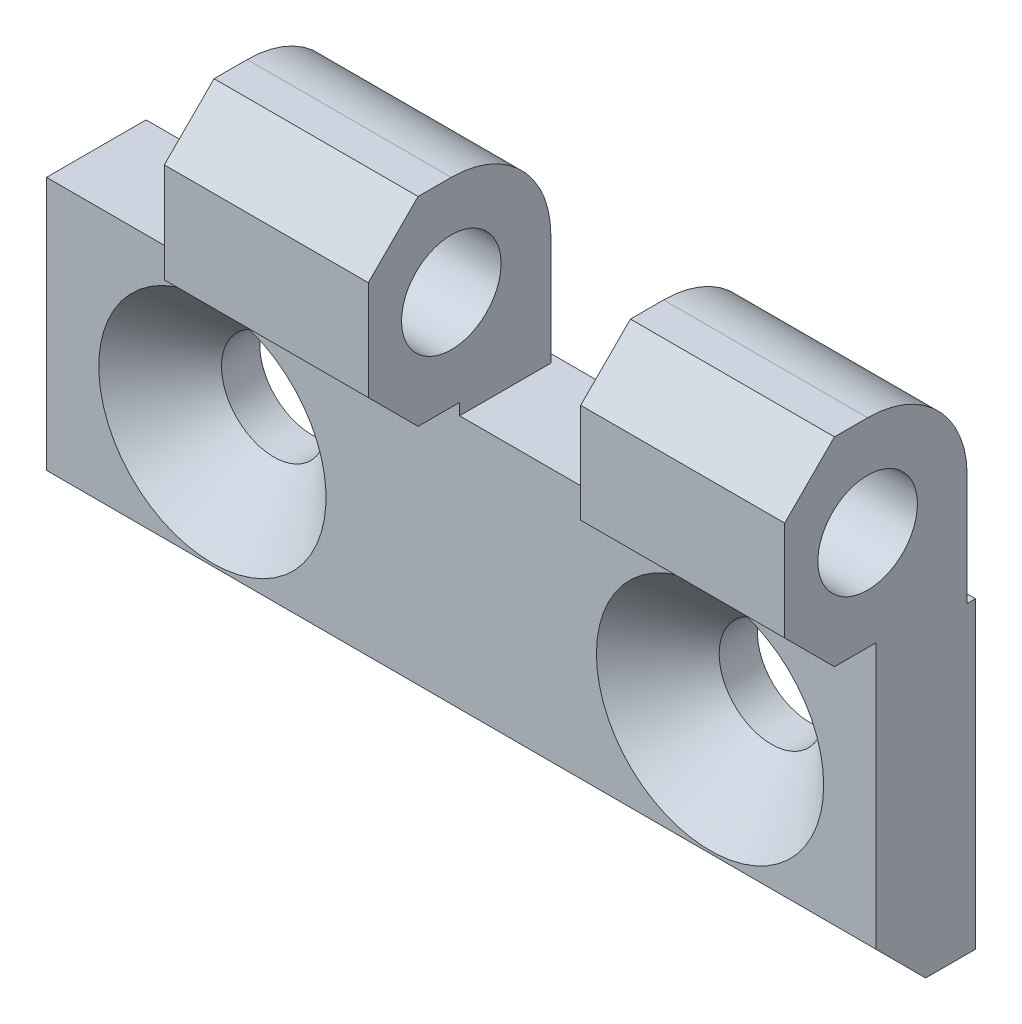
ISO-10303-21;
HEADER;
FILE_DESCRIPTION(('STEP AP214'),'2;1');
FILE_NAME('part.step','',(''),(''),'','','');
FILE_SCHEMA(('AUTOMOTIVE_DESIGN { 1 0 10303 214 1 1 1 1 }'));
ENDSEC;
DATA;
#1=APPLICATION_CONTEXT('core data for automotive mechanical design processes');
#2=APPLICATION_PROTOCOL_DEFINITION('international standard','automotive_design',2000,#1);
#3=PRODUCT_CONTEXT('',#1,'mechanical');
#4=PRODUCT('Part','Part','',(#3));
#5=PRODUCT_RELATED_PRODUCT_CATEGORY('part','',(#4));
#6=PRODUCT_DEFINITION_FORMATION('','',#4);
#7=PRODUCT_DEFINITION_CONTEXT('part definition',#1,'design');
#8=PRODUCT_DEFINITION('design','',#6,#7);
#9=PRODUCT_DEFINITION_SHAPE('','',#8);
#10=(LENGTH_UNIT() NAMED_UNIT(*) SI_UNIT(.MILLI.,.METRE.));
#11=(NAMED_UNIT(*) PLANE_ANGLE_UNIT() SI_UNIT($,.RADIAN.));
#12=(NAMED_UNIT(*) SI_UNIT($,.STERADIAN.) SOLID_ANGLE_UNIT());
#13=UNCERTAINTY_MEASURE_WITH_UNIT(LENGTH_MEASURE(1.E-05),#10,'distance_accuracy_value','');
#14=(GEOMETRIC_REPRESENTATION_CONTEXT(3) GLOBAL_UNCERTAINTY_ASSIGNED_CONTEXT((#13)) GLOBAL_UNIT_ASSIGNED_CONTEXT((#10,
#11,#12)) REPRESENTATION_CONTEXT('',''));
#15=CARTESIAN_POINT('',(0.,0.,0.));
#16=DIRECTION('',(0.,0.,1.));
#17=DIRECTION('',(1.,0.,0.));
#18=AXIS2_PLACEMENT_3D('',#15,#16,#17);
#19=CARTESIAN_POINT('',(14.9,12.,11.5));
#20=DIRECTION('',(0.,-0.707106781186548,0.707106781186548));
#21=DIRECTION('',(0.,0.707106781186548,0.707106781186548));
#22=AXIS2_PLACEMENT_3D('',#19,#20,#21);
#23=PLANE('',#22);
#24=DIRECTION('',(0.,0.707106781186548,0.707106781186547));
#25=VECTOR('',#24,1.);
#26=CARTESIAN_POINT('',(14.9,9.,8.5));
#27=LINE('',#26,#25);
#28=CARTESIAN_POINT('',(14.9,9.,8.5));
#29=VERTEX_POINT('',#28);
#30=CARTESIAN_POINT('',(14.9,12.,11.5));
#31=VERTEX_POINT('',#30);
#32=EDGE_CURVE('E598',#29,#31,#27,.T.);
#33=ORIENTED_EDGE('',*,*,#32,.T.);
#34=DIRECTION('',(-1.,0.,0.));
#35=VECTOR('',#34,1.);
#36=CARTESIAN_POINT('',(14.9,12.,11.5));
#37=LINE('',#36,#35);
#38=CARTESIAN_POINT('',(2.6,12.,11.5));
#39=VERTEX_POINT('',#38);
#40=EDGE_CURVE('E621',#39,#31,#37,.F.);
#41=ORIENTED_EDGE('',*,*,#40,.F.);
#42=DIRECTION('',(0.,0.707106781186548,0.707106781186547));
#43=VECTOR('',#42,1.);
#44=CARTESIAN_POINT('',(2.6,9.,8.5));
#45=LINE('',#44,#43);
#46=CARTESIAN_POINT('',(2.6,9.,8.5));
#47=VERTEX_POINT('',#46);
#48=EDGE_CURVE('E234',#47,#39,#45,.T.);
#49=ORIENTED_EDGE('',*,*,#48,.F.);
#50=DIRECTION('',(1.,0.,0.));
#51=VECTOR('',#50,1.);
#52=CARTESIAN_POINT('',(14.9,9.,8.5));
#53=LINE('',#52,#51);
#54=EDGE_CURVE('E244',#29,#47,#53,.F.);
#55=ORIENTED_EDGE('',*,*,#54,.F.);
#56=EDGE_LOOP('',(#33,#41,#49,#55));
#57=FACE_BOUND('',#56,.T.);
#58=ADVANCED_FACE('F14',(#57),#23,.T.);
#59=CARTESIAN_POINT('',(14.9,9.,11.5));
#60=DIRECTION('',(0.,0.,1.));
#61=DIRECTION('',(-1.,0.,0.));
#62=AXIS2_PLACEMENT_3D('',#59,#60,#61);
#63=PLANE('',#62);
#64=ORIENTED_EDGE('',*,*,#40,.T.);
#65=DIRECTION('',(0.,-1.,0.));
#66=VECTOR('',#65,1.);
#67=CARTESIAN_POINT('',(14.9,-0.85,11.5));
#68=LINE('',#67,#66);
#69=CARTESIAN_POINT('',(14.9,18.,11.5));
#70=VERTEX_POINT('',#69);
#71=EDGE_CURVE('E616',#31,#70,#68,.F.);
#72=ORIENTED_EDGE('',*,*,#71,.T.);
#73=DIRECTION('',(-1.,0.,0.));
#74=VECTOR('',#73,1.);
#75=CARTESIAN_POINT('',(14.9,18.,11.5));
#76=LINE('',#75,#74);
#77=CARTESIAN_POINT('',(2.6,18.,11.5));
#78=VERTEX_POINT('',#77);
#79=EDGE_CURVE('E612',#78,#70,#76,.F.);
#80=ORIENTED_EDGE('',*,*,#79,.F.);
#81=DIRECTION('',(0.,-1.,0.));
#82=VECTOR('',#81,1.);
#83=CARTESIAN_POINT('',(2.6,-0.85,11.5));
#84=LINE('',#83,#82);
#85=EDGE_CURVE('E229',#39,#78,#84,.F.);
#86=ORIENTED_EDGE('',*,*,#85,.F.);
#87=EDGE_LOOP('',(#64,#72,#80,#86));
#88=FACE_BOUND('',#87,.T.);
#89=ADVANCED_FACE('F654',(#88),#63,.T.);
#90=CARTESIAN_POINT('',(14.9,21.,8.5));
#91=DIRECTION('',(0.,0.707106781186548,0.707106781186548));
#92=DIRECTION('',(0.,0.707106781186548,-0.707106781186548));
#93=AXIS2_PLACEMENT_3D('',#90,#91,#92);
#94=PLANE('',#93);
#95=DIRECTION('',(0.,0.707106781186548,-0.707106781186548));
#96=VECTOR('',#95,1.);
#97=CARTESIAN_POINT('',(14.9,18.,11.5));
#98=LINE('',#97,#96);
#99=CARTESIAN_POINT('',(14.9,21.,8.5));
#100=VERTEX_POINT('',#99);
#101=EDGE_CURVE('E537',#70,#100,#98,.T.);
#102=ORIENTED_EDGE('',*,*,#101,.T.);
#103=DIRECTION('',(-1.,0.,0.));
#104=VECTOR('',#103,1.);
#105=CARTESIAN_POINT('',(14.9,21.,8.5));
#106=LINE('',#105,#104);
#107=CARTESIAN_POINT('',(2.6,21.,8.5));
#108=VERTEX_POINT('',#107);
#109=EDGE_CURVE('E609',#108,#100,#106,.F.);
#110=ORIENTED_EDGE('',*,*,#109,.F.);
#111=DIRECTION('',(0.,0.707106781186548,-0.707106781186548));
#112=VECTOR('',#111,1.);
#113=CARTESIAN_POINT('',(2.6,18.,11.5));
#114=LINE('',#113,#112);
#115=EDGE_CURVE('E227',#78,#108,#114,.T.);
#116=ORIENTED_EDGE('',*,*,#115,.F.);
#117=ORIENTED_EDGE('',*,*,#79,.T.);
#118=EDGE_LOOP('',(#102,#110,#116,#117));
#119=FACE_BOUND('',#118,.T.);
#120=ADVANCED_FACE('F657',(#119),#94,.T.);
#121=CARTESIAN_POINT('',(14.9,21.,11.5));
#122=DIRECTION('',(0.,1.,0.));
#123=DIRECTION('',(-1.,0.,0.));
#124=AXIS2_PLACEMENT_3D('',#121,#122,#123);
#125=PLANE('',#124);
#126=ORIENTED_EDGE('',*,*,#109,.T.);
#127=DIRECTION('',(0.,0.,1.));
#128=VECTOR('',#127,1.);
#129=CARTESIAN_POINT('',(14.9,21.,0.));
#130=LINE('',#129,#128);
#131=CARTESIAN_POINT('',(14.9,21.,6.5));
#132=VERTEX_POINT('',#131);
#133=EDGE_CURVE('E535',#100,#132,#130,.F.);
#134=ORIENTED_EDGE('',*,*,#133,.T.);
#135=DIRECTION('',(-1.,0.,0.));
#136=VECTOR('',#135,1.);
#137=CARTESIAN_POINT('',(14.9,21.,6.5));
#138=LINE('',#137,#136);
#139=CARTESIAN_POINT('',(2.6,21.,6.5));
#140=VERTEX_POINT('',#139);
#141=EDGE_CURVE('E187',#140,#132,#138,.F.);
#142=ORIENTED_EDGE('',*,*,#141,.F.);
#143=DIRECTION('',(0.,0.,1.));
#144=VECTOR('',#143,1.);
#145=CARTESIAN_POINT('',(2.6,21.,0.));
#146=LINE('',#145,#144);
#147=EDGE_CURVE('E200',#108,#140,#146,.F.);
#148=ORIENTED_EDGE('',*,*,#147,.F.);
#149=EDGE_LOOP('',(#126,#134,#142,#148));
#150=FACE_BOUND('',#149,.T.);
#151=ADVANCED_FACE('F659',(#150),#125,.T.);
#152=CARTESIAN_POINT('',(14.9,15.,6.5));
#153=DIRECTION('',(-1.,0.,0.));
#154=DIRECTION('',(0.,-1.,0.));
#155=AXIS2_PLACEMENT_3D('',#152,#153,#154);
#156=CYLINDRICAL_SURFACE('',#155,6.);
#157=ORIENTED_EDGE('',*,*,#141,.T.);
#158=CARTESIAN_POINT('',(14.9,15.,6.5));
#159=DIRECTION('',(-1.,0.,0.));
#160=DIRECTION('',(0.,-1.,0.));
#161=AXIS2_PLACEMENT_3D('',#158,#159,#160);
#162=CIRCLE('',#161,6.);
#163=CARTESIAN_POINT('',(14.9,15.,0.5));
#164=VERTEX_POINT('',#163);
#165=EDGE_CURVE('E206',#132,#164,#162,.T.);
#166=ORIENTED_EDGE('',*,*,#165,.T.);
#167=DIRECTION('',(1.,0.,0.));
#168=VECTOR('',#167,1.);
#169=CARTESIAN_POINT('',(14.9,15.,0.5));
#170=LINE('',#169,#168);
#171=CARTESIAN_POINT('',(2.6,15.,0.5));
#172=VERTEX_POINT('',#171);
#173=EDGE_CURVE('E203',#172,#164,#170,.T.);
#174=ORIENTED_EDGE('',*,*,#173,.F.);
#175=CARTESIAN_POINT('',(2.6,15.,6.5));
#176=DIRECTION('',(-1.,0.,0.));
#177=DIRECTION('',(0.,-1.,0.));
#178=AXIS2_PLACEMENT_3D('',#175,#176,#177);
#179=CIRCLE('',#178,6.);
#180=EDGE_CURVE('E17',#140,#172,#179,.T.);
#181=ORIENTED_EDGE('',*,*,#180,.F.);
#182=EDGE_LOOP('',(#157,#166,#174,#181));
#183=FACE_BOUND('',#182,.T.);
#184=ADVANCED_FACE('F204',(#183),#156,.T.);
#185=CARTESIAN_POINT('',(14.9,9.,6.));
#186=DIRECTION('',(0.,-1.,0.));
#187=DIRECTION('',(1.,0.,0.));
#188=AXIS2_PLACEMENT_3D('',#185,#186,#187);
#189=PLANE('',#188);
#190=DIRECTION('',(-1.,0.,0.));
#191=VECTOR('',#190,1.);
#192=CARTESIAN_POINT('',(40.,9.,6.));
#193=LINE('',#192,#191);
#194=CARTESIAN_POINT('',(14.9,9.,6.));
#195=VERTEX_POINT('',#194);
#196=CARTESIAN_POINT('',(2.6,9.,6.));
#197=VERTEX_POINT('',#196);
#198=EDGE_CURVE('E251',#195,#197,#193,.T.);
#199=ORIENTED_EDGE('',*,*,#198,.F.);
#200=DIRECTION('',(0.,0.,1.));
#201=VECTOR('',#200,1.);
#202=CARTESIAN_POINT('',(14.9,9.,0.));
#203=LINE('',#202,#201);
#204=EDGE_CURVE('E209',#195,#29,#203,.T.);
#205=ORIENTED_EDGE('',*,*,#204,.T.);
#206=ORIENTED_EDGE('',*,*,#54,.T.);
#207=DIRECTION('',(0.,0.,1.));
#208=VECTOR('',#207,1.);
#209=CARTESIAN_POINT('',(2.6,9.,0.));
#210=LINE('',#209,#208);
#211=EDGE_CURVE('E239',#197,#47,#210,.T.);
#212=ORIENTED_EDGE('',*,*,#211,.F.);
#213=EDGE_LOOP('',(#199,#205,#206,#212));
#214=FACE_BOUND('',#213,.T.);
#215=ADVANCED_FACE('F637',(#214),#189,.T.);
#216=CARTESIAN_POINT('',(27.7,-0.85,0.));
#217=DIRECTION('',(1.,0.,0.));
#218=DIRECTION('',(0.,1.,0.));
#219=AXIS2_PLACEMENT_3D('',#216,#217,#218);
#220=PLANE('',#219);
#221=DIRECTION('',(0.,-1.,0.));
#222=VECTOR('',#221,1.);
#223=CARTESIAN_POINT('',(27.7,-10.,6.));
#224=LINE('',#223,#222);
#225=CARTESIAN_POINT('',(27.7,9.,6.));
#226=VERTEX_POINT('',#225);
#227=CARTESIAN_POINT('',(27.7,8.3,6.));
#228=VERTEX_POINT('',#227);
#229=EDGE_CURVE('E532',#226,#228,#224,.T.);
#230=ORIENTED_EDGE('',*,*,#229,.F.);
#231=DIRECTION('',(0.,0.,1.));
#232=VECTOR('',#231,1.);
#233=CARTESIAN_POINT('',(27.7,9.,11.5));
#234=LINE('',#233,#232);
#235=CARTESIAN_POINT('',(27.7,9.,8.5));
#236=VERTEX_POINT('',#235);
#237=EDGE_CURVE('E516',#236,#226,#234,.F.);
#238=ORIENTED_EDGE('',*,*,#237,.F.);
#239=DIRECTION('',(0.,0.707106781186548,0.707106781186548));
#240=VECTOR('',#239,1.);
#241=CARTESIAN_POINT('',(27.7,9.,8.5));
#242=LINE('',#241,#240);
#243=CARTESIAN_POINT('',(27.7,12.,11.5));
#244=VERTEX_POINT('',#243);
#245=EDGE_CURVE('E507',#244,#236,#242,.F.);
#246=ORIENTED_EDGE('',*,*,#245,.F.);
#247=DIRECTION('',(0.,-1.,0.));
#248=VECTOR('',#247,1.);
#249=CARTESIAN_POINT('',(27.7,21.,11.5));
#250=LINE('',#249,#248);
#251=CARTESIAN_POINT('',(27.7,18.,11.5));
#252=VERTEX_POINT('',#251);
#253=EDGE_CURVE('E497',#252,#244,#250,.T.);
#254=ORIENTED_EDGE('',*,*,#253,.F.);
#255=DIRECTION('',(0.,0.707106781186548,-0.707106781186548));
#256=VECTOR('',#255,1.);
#257=CARTESIAN_POINT('',(27.7,18.,11.5));
#258=LINE('',#257,#256);
#259=CARTESIAN_POINT('',(27.7,21.,8.5));
#260=VERTEX_POINT('',#259);
#261=EDGE_CURVE('E487',#260,#252,#258,.F.);
#262=ORIENTED_EDGE('',*,*,#261,.F.);
#263=DIRECTION('',(0.,0.,1.));
#264=VECTOR('',#263,1.);
#265=CARTESIAN_POINT('',(27.7,21.,6.5));
#266=LINE('',#265,#264);
#267=CARTESIAN_POINT('',(27.7,21.,6.5));
#268=VERTEX_POINT('',#267);
#269=EDGE_CURVE('E474',#268,#260,#266,.T.);
#270=ORIENTED_EDGE('',*,*,#269,.F.);
#271=CARTESIAN_POINT('',(27.7,15.,6.5));
#272=DIRECTION('',(1.,0.,0.));
#273=DIRECTION('',(0.,1.,0.));
#274=AXIS2_PLACEMENT_3D('',#271,#272,#273);
#275=CIRCLE('',#274,6.);
#276=CARTESIAN_POINT('',(27.7,15.,0.5));
#277=VERTEX_POINT('',#276);
#278=EDGE_CURVE('E473',#277,#268,#275,.T.);
#279=ORIENTED_EDGE('',*,*,#278,.F.);
#280=DIRECTION('',(0.,-1.,0.));
#281=VECTOR('',#280,1.);
#282=CARTESIAN_POINT('',(27.7,8.3,0.5));
#283=LINE('',#282,#281);
#284=CARTESIAN_POINT('',(27.7,8.3,0.5));
#285=VERTEX_POINT('',#284);
#286=EDGE_CURVE('E460',#285,#277,#283,.F.);
#287=ORIENTED_EDGE('',*,*,#286,.F.);
#288=DIRECTION('',(0.,0.,1.));
#289=VECTOR('',#288,1.);
#290=CARTESIAN_POINT('',(27.7,8.3,6.));
#291=LINE('',#290,#289);
#292=EDGE_CURVE('E463',#228,#285,#291,.F.);
#293=ORIENTED_EDGE('',*,*,#292,.F.);
#294=EDGE_LOOP('',(#230,#238,#246,#254,#262,#270,#279,#287,#293));
#295=FACE_BOUND('',#294,.T.);
#296=CARTESIAN_POINT('',(27.7,15.,6.5));
#297=DIRECTION('',(1.,0.,0.));
#298=DIRECTION('',(0.,0.,-1.));
#299=AXIS2_PLACEMENT_3D('',#296,#297,#298);
#300=CIRCLE('',#299,3.);
#301=CARTESIAN_POINT('',(27.7,15.,3.5));
#302=VERTEX_POINT('',#301);
#303=EDGE_CURVE('E629',#302,#302,#300,.F.);
#304=ORIENTED_EDGE('',*,*,#303,.F.);
#305=EDGE_LOOP('',(#304));
#306=FACE_BOUND('',#305,.T.);
#307=ADVANCED_FACE('F695',(#295,#306),#220,.F.);
#308=CARTESIAN_POINT('',(2.6,-0.85,0.));
#309=DIRECTION('',(-1.,0.,0.));
#310=DIRECTION('',(0.,-1.,0.));
#311=AXIS2_PLACEMENT_3D('',#308,#309,#310);
#312=PLANE('',#311);
#313=DIRECTION('',(0.,-1.,0.));
#314=VECTOR('',#313,1.);
#315=CARTESIAN_POINT('',(2.6,15.,0.5));
#316=LINE('',#315,#314);
#317=CARTESIAN_POINT('',(2.6,8.3,0.5));
#318=VERTEX_POINT('',#317);
#319=EDGE_CURVE('E197',#318,#172,#316,.F.);
#320=ORIENTED_EDGE('',*,*,#319,.F.);
#321=DIRECTION('',(0.,0.,1.));
#322=VECTOR('',#321,1.);
#323=CARTESIAN_POINT('',(2.6,8.3,6.));
#324=LINE('',#323,#322);
#325=CARTESIAN_POINT('',(2.6,8.3,6.));
#326=VERTEX_POINT('',#325);
#327=EDGE_CURVE('E222',#326,#318,#324,.F.);
#328=ORIENTED_EDGE('',*,*,#327,.F.);
#329=DIRECTION('',(0.,-1.,0.));
#330=VECTOR('',#329,1.);
#331=CARTESIAN_POINT('',(2.6,-10.,6.));
#332=LINE('',#331,#330);
#333=EDGE_CURVE('E247',#197,#326,#332,.T.);
#334=ORIENTED_EDGE('',*,*,#333,.F.);
#335=ORIENTED_EDGE('',*,*,#211,.T.);
#336=ORIENTED_EDGE('',*,*,#48,.T.);
#337=ORIENTED_EDGE('',*,*,#85,.T.);
#338=ORIENTED_EDGE('',*,*,#115,.T.);
#339=ORIENTED_EDGE('',*,*,#147,.T.);
#340=ORIENTED_EDGE('',*,*,#180,.T.);
#341=EDGE_LOOP('',(#320,#328,#334,#335,#336,#337,#338,#339,#340));
#342=FACE_BOUND('',#341,.T.);
#343=CARTESIAN_POINT('',(2.6,15.,6.5));
#344=DIRECTION('',(-1.,0.,0.));
#345=DIRECTION('',(0.,0.,1.));
#346=AXIS2_PLACEMENT_3D('',#343,#344,#345);
#347=CIRCLE('',#346,3.);
#348=CARTESIAN_POINT('',(2.6,15.,9.5));
#349=VERTEX_POINT('',#348);
#350=EDGE_CURVE('E947',#349,#349,#347,.T.);
#351=ORIENTED_EDGE('',*,*,#350,.F.);
#352=EDGE_LOOP('',(#351));
#353=FACE_BOUND('',#352,.T.);
#354=ADVANCED_FACE('F193',(#342,#353),#312,.T.);
#355=CARTESIAN_POINT('',(14.9,15.,0.5));
#356=DIRECTION('',(0.,0.,-1.));
#357=DIRECTION('',(1.,0.,0.));
#358=AXIS2_PLACEMENT_3D('',#355,#356,#357);
#359=PLANE('',#358);
#360=DIRECTION('',(0.,-1.,0.));
#361=VECTOR('',#360,1.);
#362=CARTESIAN_POINT('',(14.9,-0.85,0.5));
#363=LINE('',#362,#361);
#364=CARTESIAN_POINT('',(14.9,8.3,0.5));
#365=VERTEX_POINT('',#364);
#366=EDGE_CURVE('E530',#164,#365,#363,.T.);
#367=ORIENTED_EDGE('',*,*,#366,.T.);
#368=DIRECTION('',(-1.,0.,0.));
#369=VECTOR('',#368,1.);
#370=CARTESIAN_POINT('',(40.,8.3,0.5));
#371=LINE('',#370,#369);
#372=EDGE_CURVE('E213',#318,#365,#371,.F.);
#373=ORIENTED_EDGE('',*,*,#372,.F.);
#374=ORIENTED_EDGE('',*,*,#319,.T.);
#375=ORIENTED_EDGE('',*,*,#173,.T.);
#376=EDGE_LOOP('',(#367,#373,#374,#375));
#377=FACE_BOUND('',#376,.T.);
#378=ADVANCED_FACE('F211',(#377),#359,.T.);
#379=CARTESIAN_POINT('',(14.9,-0.85,0.));
#380=DIRECTION('',(-1.,0.,0.));
#381=DIRECTION('',(0.,-1.,0.));
#382=AXIS2_PLACEMENT_3D('',#379,#380,#381);
#383=PLANE('',#382);
#384=ORIENTED_EDGE('',*,*,#165,.F.);
#385=ORIENTED_EDGE('',*,*,#133,.F.);
#386=ORIENTED_EDGE('',*,*,#101,.F.);
#387=ORIENTED_EDGE('',*,*,#71,.F.);
#388=ORIENTED_EDGE('',*,*,#32,.F.);
#389=ORIENTED_EDGE('',*,*,#204,.F.);
#390=DIRECTION('',(0.,-1.,0.));
#391=VECTOR('',#390,1.);
#392=CARTESIAN_POINT('',(14.9,-10.,6.));
#393=LINE('',#392,#391);
#394=CARTESIAN_POINT('',(14.9,8.3,6.));
#395=VERTEX_POINT('',#394);
#396=EDGE_CURVE('E557',#395,#195,#393,.F.);
#397=ORIENTED_EDGE('',*,*,#396,.F.);
#398=DIRECTION('',(0.,0.,1.));
#399=VECTOR('',#398,1.);
#400=CARTESIAN_POINT('',(14.9,8.3,6.));
#401=LINE('',#400,#399);
#402=EDGE_CURVE('E520',#365,#395,#401,.T.);
#403=ORIENTED_EDGE('',*,*,#402,.F.);
#404=ORIENTED_EDGE('',*,*,#366,.F.);
#405=EDGE_LOOP('',(#384,#385,#386,#387,#388,#389,#397,#403,#404));
#406=FACE_BOUND('',#405,.T.);
#407=CARTESIAN_POINT('',(14.9,15.,6.5));
#408=DIRECTION('',(-1.,0.,0.));
#409=DIRECTION('',(0.,0.,1.));
#410=AXIS2_PLACEMENT_3D('',#407,#408,#409);
#411=CIRCLE('',#410,3.);
#412=CARTESIAN_POINT('',(14.9,15.,9.5));
#413=VERTEX_POINT('',#412);
#414=EDGE_CURVE('E944',#413,#413,#411,.F.);
#415=ORIENTED_EDGE('',*,*,#414,.F.);
#416=EDGE_LOOP('',(#415));
#417=FACE_BOUND('',#416,.T.);
#418=ADVANCED_FACE('F649',(#406,#417),#383,.F.);
#419=CARTESIAN_POINT('',(40.,-10.,6.));
#420=DIRECTION('',(0.,0.,1.));
#421=DIRECTION('',(-1.,0.,0.));
#422=AXIS2_PLACEMENT_3D('',#419,#420,#421);
#423=PLANE('',#422);
#424=DIRECTION('',(-1.,0.,0.));
#425=VECTOR('',#424,1.);
#426=CARTESIAN_POINT('',(40.,8.3,6.));
#427=LINE('',#426,#425);
#428=EDGE_CURVE('E548',#395,#228,#427,.F.);
#429=ORIENTED_EDGE('',*,*,#428,.F.);
#430=ORIENTED_EDGE('',*,*,#396,.T.);
#431=ORIENTED_EDGE('',*,*,#198,.T.);
#432=ORIENTED_EDGE('',*,*,#333,.T.);
#433=DIRECTION('',(-1.,0.,0.));
#434=VECTOR('',#433,1.);
#435=CARTESIAN_POINT('',(40.,8.3,6.));
#436=LINE('',#435,#434);
#437=CARTESIAN_POINT('',(-10.,8.3,6.));
#438=VERTEX_POINT('',#437);
#439=EDGE_CURVE('E224',#438,#326,#436,.F.);
#440=ORIENTED_EDGE('',*,*,#439,.F.);
#441=DIRECTION('',(0.,-1.,0.));
#442=VECTOR('',#441,1.);
#443=CARTESIAN_POINT('',(-10.,-0.85,6.));
#444=LINE('',#443,#442);
#445=CARTESIAN_POINT('',(-10.,-7.,6.));
#446=VERTEX_POINT('',#445);
#447=EDGE_CURVE('E553',#446,#438,#444,.F.);
#448=ORIENTED_EDGE('',*,*,#447,.F.);
#449=DIRECTION('',(-1.,0.,0.));
#450=VECTOR('',#449,1.);
#451=CARTESIAN_POINT('',(40.,-7.,6.));
#452=LINE('',#451,#450);
#453=CARTESIAN_POINT('',(40.,-7.,6.));
#454=VERTEX_POINT('',#453);
#455=EDGE_CURVE('E452',#454,#446,#452,.T.);
#456=ORIENTED_EDGE('',*,*,#455,.F.);
#457=DIRECTION('',(0.,-1.,0.));
#458=VECTOR('',#457,1.);
#459=CARTESIAN_POINT('',(40.,-0.85,6.));
#460=LINE('',#459,#458);
#461=CARTESIAN_POINT('',(40.,9.,6.));
#462=VERTEX_POINT('',#461);
#463=EDGE_CURVE('E511',#454,#462,#460,.F.);
#464=ORIENTED_EDGE('',*,*,#463,.T.);
#465=DIRECTION('',(1.,0.,0.));
#466=VECTOR('',#465,1.);
#467=CARTESIAN_POINT('',(27.7,9.,6.));
#468=LINE('',#467,#466);
#469=EDGE_CURVE('E250',#226,#462,#468,.T.);
#470=ORIENTED_EDGE('',*,*,#469,.F.);
#471=ORIENTED_EDGE('',*,*,#229,.T.);
#472=EDGE_LOOP('',(#429,#430,#431,#432,#440,#448,#456,#464,#470,#471));
#473=FACE_BOUND('',#472,.T.);
#474=CARTESIAN_POINT('',(30.,0.,5.99999999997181));
#475=DIRECTION('',(0.,0.,1.));
#476=DIRECTION('',(-1.,0.,0.));
#477=AXIS2_PLACEMENT_3D('',#474,#475,#476);
#478=CIRCLE('',#477,6.84999999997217);
#479=CARTESIAN_POINT('',(23.1500000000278,0.,5.99999999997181));
#480=VERTEX_POINT('',#479);
#481=EDGE_CURVE('E451',#480,#480,#478,.F.);
#482=ORIENTED_EDGE('',*,*,#481,.T.);
#483=EDGE_LOOP('',(#482));
#484=FACE_BOUND('',#483,.T.);
#485=CARTESIAN_POINT('',(0.,0.,5.99999999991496));
#486=DIRECTION('',(0.,0.,1.));
#487=DIRECTION('',(0.,1.,0.));
#488=AXIS2_PLACEMENT_3D('',#485,#486,#487);
#489=CIRCLE('',#488,6.8500000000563);
#490=CARTESIAN_POINT('',(0.,6.8500000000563,5.99999999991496));
#491=VERTEX_POINT('',#490);
#492=EDGE_CURVE('E441',#491,#491,#489,.F.);
#493=ORIENTED_EDGE('',*,*,#492,.T.);
#494=EDGE_LOOP('',(#493));
#495=FACE_BOUND('',#494,.T.);
#496=ADVANCED_FACE('F645',(#473,#484,#495),#423,.T.);
#497=CARTESIAN_POINT('',(27.7,9.,11.5));
#498=DIRECTION('',(0.,-1.,0.));
#499=DIRECTION('',(1.,0.,0.));
#500=AXIS2_PLACEMENT_3D('',#497,#498,#499);
#501=PLANE('',#500);
#502=DIRECTION('',(-1.,0.,0.));
#503=VECTOR('',#502,1.);
#504=CARTESIAN_POINT('',(27.7,9.,8.5));
#505=LINE('',#504,#503);
#506=CARTESIAN_POINT('',(40.,9.,8.5));
#507=VERTEX_POINT('',#506);
#508=EDGE_CURVE('E498',#236,#507,#505,.F.);
#509=ORIENTED_EDGE('',*,*,#508,.F.);
#510=ORIENTED_EDGE('',*,*,#237,.T.);
#511=ORIENTED_EDGE('',*,*,#469,.T.);
#512=DIRECTION('',(0.,0.,1.));
#513=VECTOR('',#512,1.);
#514=CARTESIAN_POINT('',(40.,9.,0.));
#515=LINE('',#514,#513);
#516=EDGE_CURVE('E502',#462,#507,#515,.T.);
#517=ORIENTED_EDGE('',*,*,#516,.T.);
#518=EDGE_LOOP('',(#509,#510,#511,#517));
#519=FACE_BOUND('',#518,.T.);
#520=ADVANCED_FACE('F737',(#519),#501,.T.);
#521=CARTESIAN_POINT('',(27.7,9.,8.5));
#522=DIRECTION('',(0.,-0.707106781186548,0.707106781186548));
#523=DIRECTION('',(0.,0.707106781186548,0.707106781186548));
#524=AXIS2_PLACEMENT_3D('',#521,#522,#523);
#525=PLANE('',#524);
#526=ORIENTED_EDGE('',*,*,#245,.T.);
#527=ORIENTED_EDGE('',*,*,#508,.T.);
#528=DIRECTION('',(0.,0.707106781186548,0.707106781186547));
#529=VECTOR('',#528,1.);
#530=CARTESIAN_POINT('',(40.,9.,8.5));
#531=LINE('',#530,#529);
#532=CARTESIAN_POINT('',(40.,12.,11.5));
#533=VERTEX_POINT('',#532);
#534=EDGE_CURVE('E491',#507,#533,#531,.T.);
#535=ORIENTED_EDGE('',*,*,#534,.T.);
#536=DIRECTION('',(-1.,0.,0.));
#537=VECTOR('',#536,1.);
#538=CARTESIAN_POINT('',(27.7,12.,11.5));
#539=LINE('',#538,#537);
#540=EDGE_CURVE('E494',#244,#533,#539,.F.);
#541=ORIENTED_EDGE('',*,*,#540,.F.);
#542=EDGE_LOOP('',(#526,#527,#535,#541));
#543=FACE_BOUND('',#542,.T.);
#544=ADVANCED_FACE('F746',(#543),#525,.T.);
#545=CARTESIAN_POINT('',(27.7,21.,11.5));
#546=DIRECTION('',(0.,0.,1.));
#547=DIRECTION('',(-1.,0.,0.));
#548=AXIS2_PLACEMENT_3D('',#545,#546,#547);
#549=PLANE('',#548);
#550=DIRECTION('',(-1.,0.,0.));
#551=VECTOR('',#550,1.);
#552=CARTESIAN_POINT('',(27.7,18.,11.5));
#553=LINE('',#552,#551);
#554=CARTESIAN_POINT('',(40.,18.,11.5));
#555=VERTEX_POINT('',#554);
#556=EDGE_CURVE('E478',#252,#555,#553,.F.);
#557=ORIENTED_EDGE('',*,*,#556,.F.);
#558=ORIENTED_EDGE('',*,*,#253,.T.);
#559=ORIENTED_EDGE('',*,*,#540,.T.);
#560=DIRECTION('',(0.,-1.,0.));
#561=VECTOR('',#560,1.);
#562=CARTESIAN_POINT('',(40.,-0.85,11.5));
#563=LINE('',#562,#561);
#564=EDGE_CURVE('E482',#533,#555,#563,.F.);
#565=ORIENTED_EDGE('',*,*,#564,.T.);
#566=EDGE_LOOP('',(#557,#558,#559,#565));
#567=FACE_BOUND('',#566,.T.);
#568=ADVANCED_FACE('F756',(#567),#549,.T.);
#569=CARTESIAN_POINT('',(27.7,18.,11.5));
#570=DIRECTION('',(0.,0.707106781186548,0.707106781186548));
#571=DIRECTION('',(0.,0.707106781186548,-0.707106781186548));
#572=AXIS2_PLACEMENT_3D('',#569,#570,#571);
#573=PLANE('',#572);
#574=ORIENTED_EDGE('',*,*,#261,.T.);
#575=ORIENTED_EDGE('',*,*,#556,.T.);
#576=DIRECTION('',(0.,0.707106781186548,-0.707106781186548));
#577=VECTOR('',#576,1.);
#578=CARTESIAN_POINT('',(40.,18.,11.5));
#579=LINE('',#578,#577);
#580=CARTESIAN_POINT('',(40.,21.,8.5));
#581=VERTEX_POINT('',#580);
#582=EDGE_CURVE('E425',#555,#581,#579,.T.);
#583=ORIENTED_EDGE('',*,*,#582,.T.);
#584=DIRECTION('',(-1.,0.,0.));
#585=VECTOR('',#584,1.);
#586=CARTESIAN_POINT('',(27.7,21.,8.5));
#587=LINE('',#586,#585);
#588=EDGE_CURVE('E475',#260,#581,#587,.F.);
#589=ORIENTED_EDGE('',*,*,#588,.F.);
#590=EDGE_LOOP('',(#574,#575,#583,#589));
#591=FACE_BOUND('',#590,.T.);
#592=ADVANCED_FACE('F766',(#591),#573,.T.);
#593=CARTESIAN_POINT('',(27.7,21.,6.5));
#594=DIRECTION('',(0.,1.,0.));
#595=DIRECTION('',(-1.,0.,0.));
#596=AXIS2_PLACEMENT_3D('',#593,#594,#595);
#597=PLANE('',#596);
#598=DIRECTION('',(1.,0.,0.));
#599=VECTOR('',#598,1.);
#600=CARTESIAN_POINT('',(27.7,21.,6.5));
#601=LINE('',#600,#599);
#602=CARTESIAN_POINT('',(40.,21.,6.5));
#603=VERTEX_POINT('',#602);
#604=EDGE_CURVE('E470',#268,#603,#601,.T.);
#605=ORIENTED_EDGE('',*,*,#604,.F.);
#606=ORIENTED_EDGE('',*,*,#269,.T.);
#607=ORIENTED_EDGE('',*,*,#588,.T.);
#608=DIRECTION('',(0.,0.,1.));
#609=VECTOR('',#608,1.);
#610=CARTESIAN_POINT('',(40.,21.,0.));
#611=LINE('',#610,#609);
#612=EDGE_CURVE('E423',#581,#603,#611,.F.);
#613=ORIENTED_EDGE('',*,*,#612,.T.);
#614=EDGE_LOOP('',(#605,#606,#607,#613));
#615=FACE_BOUND('',#614,.T.);
#616=ADVANCED_FACE('F776',(#615),#597,.T.);
#617=CARTESIAN_POINT('',(27.7,15.,6.5));
#618=DIRECTION('',(1.,0.,0.));
#619=DIRECTION('',(0.,1.,0.));
#620=AXIS2_PLACEMENT_3D('',#617,#618,#619);
#621=CYLINDRICAL_SURFACE('',#620,6.);
#622=DIRECTION('',(1.,0.,0.));
#623=VECTOR('',#622,1.);
#624=CARTESIAN_POINT('',(27.7,15.,0.5));
#625=LINE('',#624,#623);
#626=CARTESIAN_POINT('',(40.,15.,0.5));
#627=VERTEX_POINT('',#626);
#628=EDGE_CURVE('E457',#277,#627,#625,.T.);
#629=ORIENTED_EDGE('',*,*,#628,.F.);
#630=ORIENTED_EDGE('',*,*,#278,.T.);
#631=ORIENTED_EDGE('',*,*,#604,.T.);
#632=CARTESIAN_POINT('',(40.,15.,6.5));
#633=DIRECTION('',(1.,0.,0.));
#634=DIRECTION('',(0.,1.,0.));
#635=AXIS2_PLACEMENT_3D('',#632,#633,#634);
#636=CIRCLE('',#635,6.);
#637=EDGE_CURVE('E420',#603,#627,#636,.F.);
#638=ORIENTED_EDGE('',*,*,#637,.T.);
#639=EDGE_LOOP('',(#629,#630,#631,#638));
#640=FACE_BOUND('',#639,.T.);
#641=ADVANCED_FACE('F786',(#640),#621,.T.);
#642=CARTESIAN_POINT('',(27.7,8.3,0.5));
#643=DIRECTION('',(0.,0.,-1.));
#644=DIRECTION('',(1.,0.,0.));
#645=AXIS2_PLACEMENT_3D('',#642,#643,#644);
#646=PLANE('',#645);
#647=ORIENTED_EDGE('',*,*,#286,.T.);
#648=ORIENTED_EDGE('',*,*,#628,.T.);
#649=DIRECTION('',(0.,-1.,0.));
#650=VECTOR('',#649,1.);
#651=CARTESIAN_POINT('',(40.,-0.85,0.5));
#652=LINE('',#651,#650);
#653=CARTESIAN_POINT('',(40.,8.3,0.5));
#654=VERTEX_POINT('',#653);
#655=EDGE_CURVE('E418',#627,#654,#652,.T.);
#656=ORIENTED_EDGE('',*,*,#655,.T.);
#657=DIRECTION('',(-1.,0.,0.));
#658=VECTOR('',#657,1.);
#659=CARTESIAN_POINT('',(40.,8.3,0.5));
#660=LINE('',#659,#658);
#661=EDGE_CURVE('E433',#285,#654,#660,.F.);
#662=ORIENTED_EDGE('',*,*,#661,.F.);
#663=EDGE_LOOP('',(#647,#648,#656,#662));
#664=FACE_BOUND('',#663,.T.);
#665=ADVANCED_FACE('F796',(#664),#646,.T.);
#666=CARTESIAN_POINT('',(40.,-7.,6.));
#667=DIRECTION('',(0.,-0.707106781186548,0.707106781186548));
#668=DIRECTION('',(0.,0.707106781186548,0.707106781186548));
#669=AXIS2_PLACEMENT_3D('',#666,#667,#668);
#670=PLANE('',#669);
#671=DIRECTION('',(0.,0.707106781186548,0.707106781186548));
#672=VECTOR('',#671,1.);
#673=CARTESIAN_POINT('',(40.,-10.,3.));
#674=LINE('',#673,#672);
#675=CARTESIAN_POINT('',(40.,-10.,3.));
#676=VERTEX_POINT('',#675);
#677=EDGE_CURVE('E416',#676,#454,#674,.T.);
#678=ORIENTED_EDGE('',*,*,#677,.T.);
#679=ORIENTED_EDGE('',*,*,#455,.T.);
#680=DIRECTION('',(0.,0.707106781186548,0.707106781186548));
#681=VECTOR('',#680,1.);
#682=CARTESIAN_POINT('',(-10.,-10.,3.));
#683=LINE('',#682,#681);
#684=CARTESIAN_POINT('',(-10.,-10.,3.));
#685=VERTEX_POINT('',#684);
#686=EDGE_CURVE('E437',#685,#446,#683,.T.);
#687=ORIENTED_EDGE('',*,*,#686,.F.);
#688=DIRECTION('',(1.,0.,0.));
#689=VECTOR('',#688,1.);
#690=CARTESIAN_POINT('',(40.,-10.,3.));
#691=LINE('',#690,#689);
#692=EDGE_CURVE('E438',#676,#685,#691,.F.);
#693=ORIENTED_EDGE('',*,*,#692,.F.);
#694=EDGE_LOOP('',(#678,#679,#687,#693));
#695=FACE_BOUND('',#694,.T.);
#696=ADVANCED_FACE('F289',(#695),#670,.T.);
#697=CARTESIAN_POINT('',(26.8143086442,4.,2.));
#698=DIRECTION('',(-1.,0.,0.));
#699=DIRECTION('',(0.,-1.,0.));
#700=AXIS2_PLACEMENT_3D('',#697,#698,#699);
#701=CYLINDRICAL_SURFACE('',#700,1.);
#702=DIRECTION('',(-1.,0.,0.));
#703=VECTOR('',#702,1.);
#704=CARTESIAN_POINT('',(3.31662479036,5.,2.));
#705=LINE('',#704,#703);
#706=CARTESIAN_POINT('',(3.316624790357,4.99999999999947,2.));
#707=VERTEX_POINT('',#706);
#708=CARTESIAN_POINT('',(26.6833752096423,5.,2.));
#709=VERTEX_POINT('',#708);
#710=EDGE_CURVE('E302',#707,#709,#705,.F.);
#711=ORIENTED_EDGE('',*,*,#710,.T.);
#712=CARTESIAN_POINT('',(25.5278640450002,3.99999999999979,3.));
#713=CARTESIAN_POINT('',(25.5627199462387,4.03897853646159,2.99998939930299));
#714=CARTESIAN_POINT('',(25.5980769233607,4.0774751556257,2.99772163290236));
#715=CARTESIAN_POINT('',(25.6695132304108,4.15326103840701,2.98892398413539));
#716=CARTESIAN_POINT('',(25.7055921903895,4.19055089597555,2.98239623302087));
#717=CARTESIAN_POINT('',(25.7785736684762,4.26406731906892,2.96524911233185));
#718=CARTESIAN_POINT('',(25.8154807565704,4.3002803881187,2.95459139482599));
#719=CARTESIAN_POINT('',(25.8894908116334,4.37108071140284,2.92936037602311));
#720=CARTESIAN_POINT('',(25.9265938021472,4.4056677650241,2.91478659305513));
#721=CARTESIAN_POINT('',(26.038469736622,4.50737450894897,2.86505194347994));
#722=CARTESIAN_POINT('',(26.1132190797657,4.5718481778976,2.82401763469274));
#723=CARTESIAN_POINT('',(26.2224743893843,4.66181793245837,2.75065412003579));
#724=CARTESIAN_POINT('',(26.2583615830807,4.69064511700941,2.72428064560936));
#725=CARTESIAN_POINT('',(26.3286252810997,4.745839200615,2.66730578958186));
#726=CARTESIAN_POINT('',(26.3630032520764,4.77220851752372,2.63670863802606));
#727=CARTESIAN_POINT('',(26.4268336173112,4.82016122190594,2.57340229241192));
#728=CARTESIAN_POINT('',(26.4564616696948,4.84195632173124,2.54103290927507));
#729=CARTESIAN_POINT('',(26.512603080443,4.88254621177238,2.4719285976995));
#730=CARTESIAN_POINT('',(26.5391176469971,4.90134216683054,2.43519537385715));
#731=CARTESIAN_POINT('',(26.5832738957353,4.9321986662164,2.36366669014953));
#732=CARTESIAN_POINT('',(26.6016577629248,4.94486084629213,2.32959802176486));
#733=CARTESIAN_POINT('',(26.6337396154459,4.96675614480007,2.25838202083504));
#734=CARTESIAN_POINT('',(26.6474564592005,4.9760030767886,2.22124785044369));
#735=CARTESIAN_POINT('',(26.6662177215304,4.98858682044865,2.15355298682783));
#736=CARTESIAN_POINT('',(26.6725465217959,4.99280457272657,2.12351752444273));
#737=CARTESIAN_POINT('',(26.6811733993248,4.99853972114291,2.062354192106));
#738=CARTESIAN_POINT('',(26.6834346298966,5.00003243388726,2.03121891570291));
#739=CARTESIAN_POINT('',(26.6833752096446,5.,2.));
#740=B_SPLINE_CURVE_WITH_KNOTS('',3,(#712,#713,#714,#715,#716,#717,#718,#719,#720,#721,#722,
#723,#724,#725,#726,#727,#728,#729,#730,#731,#732,#733,#734,#735,#736,#737,#738,#739),
.UNSPECIFIED.,.F.,.F.,(4,2,2,2,2,2,2,2,2,2,2,2,2,4),(0.,0.156779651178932,0.313480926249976,
0.471673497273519,0.629885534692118,0.948826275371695,1.10780723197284,1.26663010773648,
1.41332227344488,1.55995732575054,1.68173930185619,1.80302317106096,1.89559186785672,
1.98899496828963),.UNSPECIFIED.);
#741=CARTESIAN_POINT('',(25.5278640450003,3.9999999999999,3.));
#742=VERTEX_POINT('',#741);
#743=EDGE_CURVE('E294',#742,#709,#740,.T.);
#744=ORIENTED_EDGE('',*,*,#743,.F.);
#745=DIRECTION('',(1.,0.,0.));
#746=VECTOR('',#745,1.);
#747=CARTESIAN_POINT('',(40.,4.,3.));
#748=LINE('',#747,#746);
#749=CARTESIAN_POINT('',(4.47213595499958,4.,3.));
#750=VERTEX_POINT('',#749);
#751=EDGE_CURVE('E449',#750,#742,#748,.T.);
#752=ORIENTED_EDGE('',*,*,#751,.F.);
#753=CARTESIAN_POINT('',(3.3166247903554,5.,2.));
#754=CARTESIAN_POINT('',(3.31654762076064,5.00004212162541,2.03364561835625));
#755=CARTESIAN_POINT('',(3.3191815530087,4.99830443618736,2.06717605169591));
#756=CARTESIAN_POINT('',(3.32915847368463,4.99166925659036,2.13283734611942));
#757=CARTESIAN_POINT('',(3.33644847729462,4.98680731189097,2.16497966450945));
#758=CARTESIAN_POINT('',(3.35742923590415,4.97271096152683,2.23546875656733));
#759=CARTESIAN_POINT('',(3.37227954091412,4.96267674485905,2.27330231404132));
#760=CARTESIAN_POINT('',(3.40669436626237,4.93911666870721,2.3457145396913));
#761=CARTESIAN_POINT('',(3.42628137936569,4.92557412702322,2.38027654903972));
#762=CARTESIAN_POINT('',(3.48039714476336,4.8875793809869,2.4640406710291));
#763=CARTESIAN_POINT('',(3.51722720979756,4.86121839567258,2.5108697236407));
#764=CARTESIAN_POINT('',(3.59535701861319,4.80372576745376,2.59726427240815));
#765=CARTESIAN_POINT('',(3.6366667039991,4.77258344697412,2.63681306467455));
#766=CARTESIAN_POINT('',(3.7123721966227,4.7138156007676,2.70137189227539));
#767=CARTESIAN_POINT('',(3.74627386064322,4.68693795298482,2.72766221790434));
#768=CARTESIAN_POINT('',(3.81504548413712,4.63113318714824,2.7765613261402));
#769=CARTESIAN_POINT('',(3.84991594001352,4.60220500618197,2.7991681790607));
#770=CARTESIAN_POINT('',(3.95530441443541,4.51265228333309,2.86168336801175));
#771=CARTESIAN_POINT('',(4.02664240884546,4.44922667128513,2.89632144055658));
#772=CARTESIAN_POINT('',(4.16147800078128,4.32316093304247,2.94853006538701));
#773=CARTESIAN_POINT('',(4.22501260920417,4.26113712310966,2.96751045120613));
#774=CARTESIAN_POINT('',(4.31895659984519,4.16516689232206,2.98680268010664));
#775=CARTESIAN_POINT('',(4.35000490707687,4.13273240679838,2.99170325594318));
#776=CARTESIAN_POINT('',(4.41153710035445,4.06698598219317,2.99829990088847));
#777=CARTESIAN_POINT('',(4.44202070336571,4.03367362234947,2.99999440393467));
#778=CARTESIAN_POINT('',(4.47213595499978,3.99999999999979,3.));
#779=B_SPLINE_CURVE_WITH_KNOTS('',3,(#753,#754,#755,#756,#757,#758,#759,#760,#761,#762,#763,
#764,#765,#766,#767,#768,#769,#770,#771,#772,#773,#774,#775,#776,#777,#778),.UNSPECIFIED.,.F.,
.F.,(4,2,2,2,2,2,2,2,2,2,2,2,4),(0.,0.100603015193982,0.200081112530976,0.324977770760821,
0.450479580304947,0.644846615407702,0.839654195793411,0.991332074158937,1.14308915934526,
1.44641226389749,1.71789794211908,1.85328433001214,1.98873683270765),.UNSPECIFIED.);
#780=EDGE_CURVE('E266',#707,#750,#779,.T.);
#781=ORIENTED_EDGE('',*,*,#780,.F.);
#782=EDGE_LOOP('',(#711,#744,#752,#781));
#783=FACE_BOUND('',#782,.T.);
#784=ADVANCED_FACE('F283',(#783),#701,.F.);
#785=CARTESIAN_POINT('',(40.,8.3,3.));
#786=DIRECTION('',(0.,0.,-1.));
#787=DIRECTION('',(1.,0.,0.));
#788=AXIS2_PLACEMENT_3D('',#785,#786,#787);
#789=PLANE('',#788);
#790=CARTESIAN_POINT('',(0.,0.,3.));
#791=DIRECTION('',(0.,0.,-1.));
#792=DIRECTION('',(1.,0.,0.));
#793=AXIS2_PLACEMENT_3D('',#790,#791,#792);
#794=CIRCLE('',#793,6.);
#795=CARTESIAN_POINT('',(3.,-5.19615242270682,3.));
#796=VERTEX_POINT('',#795);
#797=EDGE_CURVE('E277',#750,#796,#794,.T.);
#798=ORIENTED_EDGE('',*,*,#797,.F.);
#799=ORIENTED_EDGE('',*,*,#751,.T.);
#800=CARTESIAN_POINT('',(30.,0.,3.));
#801=DIRECTION('',(0.,0.,-1.));
#802=DIRECTION('',(1.,0.,0.));
#803=AXIS2_PLACEMENT_3D('',#800,#801,#802);
#804=CIRCLE('',#803,6.);
#805=CARTESIAN_POINT('',(27.,-5.19615242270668,3.));
#806=VERTEX_POINT('',#805);
#807=EDGE_CURVE('E303',#806,#742,#804,.T.);
#808=ORIENTED_EDGE('',*,*,#807,.F.);
#809=DIRECTION('',(0.,1.,0.));
#810=VECTOR('',#809,1.);
#811=CARTESIAN_POINT('',(27.,-5.196152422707,3.));
#812=LINE('',#811,#810);
#813=CARTESIAN_POINT('',(27.,-7.5,3.));
#814=VERTEX_POINT('',#813);
#815=EDGE_CURVE('E408',#806,#814,#812,.F.);
#816=ORIENTED_EDGE('',*,*,#815,.T.);
#817=DIRECTION('',(1.,0.,0.));
#818=VECTOR('',#817,1.);
#819=CARTESIAN_POINT('',(27.,-7.5,3.));
#820=LINE('',#819,#818);
#821=CARTESIAN_POINT('',(3.,-7.5,3.));
#822=VERTEX_POINT('',#821);
#823=EDGE_CURVE('E385',#814,#822,#820,.F.);
#824=ORIENTED_EDGE('',*,*,#823,.T.);
#825=DIRECTION('',(0.,-1.,0.));
#826=VECTOR('',#825,1.);
#827=CARTESIAN_POINT('',(3.,-7.5,3.));
#828=LINE('',#827,#826);
#829=EDGE_CURVE('E275',#822,#796,#828,.F.);
#830=ORIENTED_EDGE('',*,*,#829,.T.);
#831=EDGE_LOOP('',(#798,#799,#808,#816,#824,#830));
#832=FACE_BOUND('',#831,.T.);
#833=ADVANCED_FACE('F288',(#832),#789,.T.);
#834=CARTESIAN_POINT('',(30.,0.,5.99999999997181));
#835=DIRECTION('',(0.,0.,1.));
#836=DIRECTION('',(-1.,0.,0.));
#837=AXIS2_PLACEMENT_3D('',#834,#835,#836);
#838=CONICAL_SURFACE('',#837,6.84999999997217,0.785398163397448);
#839=ORIENTED_EDGE('',*,*,#481,.F.);
#840=EDGE_LOOP('',(#839));
#841=FACE_BOUND('',#840,.T.);
#842=CARTESIAN_POINT('',(30.,0.,2.3));
#843=DIRECTION('',(0.,0.,-1.));
#844=DIRECTION('',(1.,0.,0.));
#845=AXIS2_PLACEMENT_3D('',#842,#843,#844);
#846=CIRCLE('',#845,3.15);
#847=CARTESIAN_POINT('',(33.15,0.,2.3));
#848=VERTEX_POINT('',#847);
#849=EDGE_CURVE('E388',#848,#848,#846,.T.);
#850=ORIENTED_EDGE('',*,*,#849,.T.);
#851=EDGE_LOOP('',(#850));
#852=FACE_BOUND('',#851,.T.);
#853=ADVANCED_FACE('F333',(#841,#852),#838,.F.);
#854=CARTESIAN_POINT('',(0.,0.,5.99999999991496));
#855=DIRECTION('',(0.,0.,1.));
#856=DIRECTION('',(0.,1.,0.));
#857=AXIS2_PLACEMENT_3D('',#854,#855,#856);
#858=CONICAL_SURFACE('',#857,6.8500000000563,0.785398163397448);
#859=ORIENTED_EDGE('',*,*,#492,.F.);
#860=EDGE_LOOP('',(#859));
#861=FACE_BOUND('',#860,.T.);
#862=CARTESIAN_POINT('',(0.,0.,2.3));
#863=DIRECTION('',(0.,0.,-1.));
#864=DIRECTION('',(1.,0.,0.));
#865=AXIS2_PLACEMENT_3D('',#862,#863,#864);
#866=CIRCLE('',#865,3.15);
#867=CARTESIAN_POINT('',(3.15,0.,2.3));
#868=VERTEX_POINT('',#867);
#869=EDGE_CURVE('E391',#868,#868,#866,.T.);
#870=ORIENTED_EDGE('',*,*,#869,.T.);
#871=EDGE_LOOP('',(#870));
#872=FACE_BOUND('',#871,.T.);
#873=ADVANCED_FACE('F330',(#861,#872),#858,.F.);
#874=CARTESIAN_POINT('',(40.,-10.,0.));
#875=DIRECTION('',(0.,-1.,0.));
#876=DIRECTION('',(1.,0.,0.));
#877=AXIS2_PLACEMENT_3D('',#874,#875,#876);
#878=PLANE('',#877);
#879=DIRECTION('',(1.,0.,0.));
#880=VECTOR('',#879,1.);
#881=CARTESIAN_POINT('',(40.,-10.,0.));
#882=LINE('',#881,#880);
#883=CARTESIAN_POINT('',(40.,-10.,0.));
#884=VERTEX_POINT('',#883);
#885=CARTESIAN_POINT('',(-10.,-10.,0.));
#886=VERTEX_POINT('',#885);
#887=EDGE_CURVE('E443',#884,#886,#882,.F.);
#888=ORIENTED_EDGE('',*,*,#887,.F.);
#889=DIRECTION('',(0.,0.,1.));
#890=VECTOR('',#889,1.);
#891=CARTESIAN_POINT('',(40.,-10.,0.));
#892=LINE('',#891,#890);
#893=EDGE_CURVE('E413',#884,#676,#892,.T.);
#894=ORIENTED_EDGE('',*,*,#893,.T.);
#895=ORIENTED_EDGE('',*,*,#692,.T.);
#896=DIRECTION('',(0.,0.,1.));
#897=VECTOR('',#896,1.);
#898=CARTESIAN_POINT('',(-10.,-10.,0.));
#899=LINE('',#898,#897);
#900=EDGE_CURVE('E434',#886,#685,#899,.T.);
#901=ORIENTED_EDGE('',*,*,#900,.F.);
#902=EDGE_LOOP('',(#888,#894,#895,#901));
#903=FACE_BOUND('',#902,.T.);
#904=ADVANCED_FACE('F326',(#903),#878,.T.);
#905=CARTESIAN_POINT('',(-10.,-0.85,0.));
#906=DIRECTION('',(-1.,0.,0.));
#907=DIRECTION('',(0.,-1.,0.));
#908=AXIS2_PLACEMENT_3D('',#905,#906,#907);
#909=PLANE('',#908);
#910=ORIENTED_EDGE('',*,*,#447,.T.);
#911=DIRECTION('',(0.,0.,1.));
#912=VECTOR('',#911,1.);
#913=CARTESIAN_POINT('',(-10.,8.3,6.));
#914=LINE('',#913,#912);
#915=CARTESIAN_POINT('',(-10.,8.3,0.));
#916=VERTEX_POINT('',#915);
#917=EDGE_CURVE('E430',#916,#438,#914,.T.);
#918=ORIENTED_EDGE('',*,*,#917,.F.);
#919=DIRECTION('',(0.,-1.,0.));
#920=VECTOR('',#919,1.);
#921=CARTESIAN_POINT('',(-10.,8.3,0.));
#922=LINE('',#921,#920);
#923=EDGE_CURVE('E971',#886,#916,#922,.F.);
#924=ORIENTED_EDGE('',*,*,#923,.F.);
#925=ORIENTED_EDGE('',*,*,#900,.T.);
#926=ORIENTED_EDGE('',*,*,#686,.T.);
#927=EDGE_LOOP('',(#910,#918,#924,#925,#926));
#928=FACE_BOUND('',#927,.T.);
#929=ADVANCED_FACE('F322',(#928),#909,.T.);
#930=CARTESIAN_POINT('',(40.,8.3,6.));
#931=DIRECTION('',(0.,1.,0.));
#932=DIRECTION('',(-1.,0.,0.));
#933=AXIS2_PLACEMENT_3D('',#930,#931,#932);
#934=PLANE('',#933);
#935=ORIENTED_EDGE('',*,*,#372,.T.);
#936=ORIENTED_EDGE('',*,*,#402,.T.);
#937=ORIENTED_EDGE('',*,*,#428,.T.);
#938=ORIENTED_EDGE('',*,*,#292,.T.);
#939=ORIENTED_EDGE('',*,*,#661,.T.);
#940=DIRECTION('',(0.,0.,1.));
#941=VECTOR('',#940,1.);
#942=CARTESIAN_POINT('',(40.,8.3,0.));
#943=LINE('',#942,#941);
#944=CARTESIAN_POINT('',(40.,8.3,0.));
#945=VERTEX_POINT('',#944);
#946=EDGE_CURVE('E417',#654,#945,#943,.F.);
#947=ORIENTED_EDGE('',*,*,#946,.T.);
#948=DIRECTION('',(1.,0.,0.));
#949=VECTOR('',#948,1.);
#950=CARTESIAN_POINT('',(40.,8.3,0.));
#951=LINE('',#950,#949);
#952=EDGE_CURVE('E968',#916,#945,#951,.T.);
#953=ORIENTED_EDGE('',*,*,#952,.F.);
#954=ORIENTED_EDGE('',*,*,#917,.T.);
#955=ORIENTED_EDGE('',*,*,#439,.T.);
#956=ORIENTED_EDGE('',*,*,#327,.T.);
#957=EDGE_LOOP('',(#935,#936,#937,#938,#939,#947,#953,#954,#955,#956));
#958=FACE_BOUND('',#957,.T.);
#959=ADVANCED_FACE('F318',(#958),#934,.T.);
#960=CARTESIAN_POINT('',(40.,-0.85,0.));
#961=DIRECTION('',(-1.,0.,0.));
#962=DIRECTION('',(0.,-1.,0.));
#963=AXIS2_PLACEMENT_3D('',#960,#961,#962);
#964=PLANE('',#963);
#965=ORIENTED_EDGE('',*,*,#946,.F.);
#966=ORIENTED_EDGE('',*,*,#655,.F.);
#967=ORIENTED_EDGE('',*,*,#637,.F.);
#968=ORIENTED_EDGE('',*,*,#612,.F.);
#969=ORIENTED_EDGE('',*,*,#582,.F.);
#970=ORIENTED_EDGE('',*,*,#564,.F.);
#971=ORIENTED_EDGE('',*,*,#534,.F.);
#972=ORIENTED_EDGE('',*,*,#516,.F.);
#973=ORIENTED_EDGE('',*,*,#463,.F.);
#974=ORIENTED_EDGE('',*,*,#677,.F.);
#975=ORIENTED_EDGE('',*,*,#893,.F.);
#976=DIRECTION('',(0.,-1.,0.));
#977=VECTOR('',#976,1.);
#978=CARTESIAN_POINT('',(40.,8.3,0.));
#979=LINE('',#978,#977);
#980=EDGE_CURVE('E963',#945,#884,#979,.T.);
#981=ORIENTED_EDGE('',*,*,#980,.F.);
#982=EDGE_LOOP('',(#965,#966,#967,#968,#969,#970,#971,#972,#973,#974,#975,#981));
#983=FACE_BOUND('',#982,.T.);
#984=CARTESIAN_POINT('',(40.,15.,6.5));
#985=DIRECTION('',(1.,0.,0.));
#986=DIRECTION('',(0.,0.,-1.));
#987=AXIS2_PLACEMENT_3D('',#984,#985,#986);
#988=CIRCLE('',#987,3.);
#989=CARTESIAN_POINT('',(40.,15.,3.5));
#990=VERTEX_POINT('',#989);
#991=EDGE_CURVE('E949',#990,#990,#988,.T.);
#992=ORIENTED_EDGE('',*,*,#991,.F.);
#993=EDGE_LOOP('',(#992));
#994=FACE_BOUND('',#993,.T.);
#995=ADVANCED_FACE('F314',(#983,#994),#964,.F.);
#996=CARTESIAN_POINT('',(27.,-5.196152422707,0.));
#997=DIRECTION('',(1.,0.,0.));
#998=DIRECTION('',(0.,1.,0.));
#999=AXIS2_PLACEMENT_3D('',#996,#997,#998);
#1000=PLANE('',#999);
#1001=ORIENTED_EDGE('',*,*,#815,.F.);
#1002=DIRECTION('',(0.,0.,-1.));
#1003=VECTOR('',#1002,1.);
#1004=CARTESIAN_POINT('',(27.,-5.19615242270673,0.));
#1005=LINE('',#1004,#1003);
#1006=CARTESIAN_POINT('',(27.,-5.19615242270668,0.));
#1007=VERTEX_POINT('',#1006);
#1008=EDGE_CURVE('E405',#1007,#806,#1005,.F.);
#1009=ORIENTED_EDGE('',*,*,#1008,.F.);
#1010=DIRECTION('',(0.,-1.,0.));
#1011=VECTOR('',#1010,1.);
#1012=CARTESIAN_POINT('',(27.,8.3,0.));
#1013=LINE('',#1012,#1011);
#1014=CARTESIAN_POINT('',(27.,-7.5,0.));
#1015=VERTEX_POINT('',#1014);
#1016=EDGE_CURVE('E265',#1015,#1007,#1013,.F.);
#1017=ORIENTED_EDGE('',*,*,#1016,.F.);
#1018=DIRECTION('',(0.,0.,1.));
#1019=VECTOR('',#1018,1.);
#1020=CARTESIAN_POINT('',(27.,-7.5,0.));
#1021=LINE('',#1020,#1019);
#1022=EDGE_CURVE('E393',#1015,#814,#1021,.T.);
#1023=ORIENTED_EDGE('',*,*,#1022,.T.);
#1024=EDGE_LOOP('',(#1001,#1009,#1017,#1023));
#1025=FACE_BOUND('',#1024,.T.);
#1026=ADVANCED_FACE('F310',(#1025),#1000,.F.);
#1027=CARTESIAN_POINT('',(30.,0.,0.));
#1028=DIRECTION('',(0.,0.,-1.));
#1029=DIRECTION('',(1.,0.,0.));
#1030=AXIS2_PLACEMENT_3D('',#1027,#1028,#1029);
#1031=CYLINDRICAL_SURFACE('',#1030,6.);
#1032=ORIENTED_EDGE('',*,*,#807,.T.);
#1033=ORIENTED_EDGE('',*,*,#743,.T.);
#1034=DIRECTION('',(0.,0.,1.));
#1035=VECTOR('',#1034,1.);
#1036=CARTESIAN_POINT('',(26.68337520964,5.,0.));
#1037=LINE('',#1036,#1035);
#1038=CARTESIAN_POINT('',(26.6833752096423,5.,0.));
#1039=VERTEX_POINT('',#1038);
#1040=EDGE_CURVE('E403',#709,#1039,#1037,.F.);
#1041=ORIENTED_EDGE('',*,*,#1040,.T.);
#1042=CARTESIAN_POINT('',(30.,0.,0.));
#1043=DIRECTION('',(0.,0.,-1.));
#1044=DIRECTION('',(1.,0.,0.));
#1045=AXIS2_PLACEMENT_3D('',#1042,#1043,#1044);
#1046=CIRCLE('',#1045,6.);
#1047=EDGE_CURVE('E262',#1007,#1039,#1046,.T.);
#1048=ORIENTED_EDGE('',*,*,#1047,.F.);
#1049=ORIENTED_EDGE('',*,*,#1008,.T.);
#1050=EDGE_LOOP('',(#1032,#1033,#1041,#1048,#1049));
#1051=FACE_BOUND('',#1050,.T.);
#1052=ADVANCED_FACE('F305',(#1051),#1031,.T.);
#1053=CARTESIAN_POINT('',(3.31662479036,5.,0.));
#1054=DIRECTION('',(0.,1.,0.));
#1055=DIRECTION('',(-1.,0.,0.));
#1056=AXIS2_PLACEMENT_3D('',#1053,#1054,#1055);
#1057=PLANE('',#1056);
#1058=DIRECTION('',(1.,0.,0.));
#1059=VECTOR('',#1058,1.);
#1060=CARTESIAN_POINT('',(40.,5.,0.));
#1061=LINE('',#1060,#1059);
#1062=CARTESIAN_POINT('',(3.316624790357,4.99999999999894,0.));
#1063=VERTEX_POINT('',#1062);
#1064=EDGE_CURVE('E261',#1039,#1063,#1061,.F.);
#1065=ORIENTED_EDGE('',*,*,#1064,.F.);
#1066=ORIENTED_EDGE('',*,*,#1040,.F.);
#1067=ORIENTED_EDGE('',*,*,#710,.F.);
#1068=DIRECTION('',(0.,0.,-1.));
#1069=VECTOR('',#1068,1.);
#1070=CARTESIAN_POINT('',(3.3166247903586,4.99999999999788,0.));
#1071=LINE('',#1070,#1069);
#1072=EDGE_CURVE('E276',#1063,#707,#1071,.F.);
#1073=ORIENTED_EDGE('',*,*,#1072,.F.);
#1074=EDGE_LOOP('',(#1065,#1066,#1067,#1073));
#1075=FACE_BOUND('',#1074,.T.);
#1076=ADVANCED_FACE('F309',(#1075),#1057,.F.);
#1077=CARTESIAN_POINT('',(0.,0.,0.));
#1078=DIRECTION('',(0.,0.,-1.));
#1079=DIRECTION('',(1.,0.,0.));
#1080=AXIS2_PLACEMENT_3D('',#1077,#1078,#1079);
#1081=CYLINDRICAL_SURFACE('',#1080,6.);
#1082=ORIENTED_EDGE('',*,*,#1072,.T.);
#1083=ORIENTED_EDGE('',*,*,#780,.T.);
#1084=ORIENTED_EDGE('',*,*,#797,.T.);
#1085=DIRECTION('',(0.,0.,1.));
#1086=VECTOR('',#1085,1.);
#1087=CARTESIAN_POINT('',(3.,-5.196152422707,0.));
#1088=LINE('',#1087,#1086);
#1089=CARTESIAN_POINT('',(3.,-5.19615242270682,0.));
#1090=VERTEX_POINT('',#1089);
#1091=EDGE_CURVE('E379',#796,#1090,#1088,.F.);
#1092=ORIENTED_EDGE('',*,*,#1091,.T.);
#1093=CARTESIAN_POINT('',(0.,0.,0.));
#1094=DIRECTION('',(0.,0.,-1.));
#1095=DIRECTION('',(1.,0.,0.));
#1096=AXIS2_PLACEMENT_3D('',#1093,#1094,#1095);
#1097=CIRCLE('',#1096,6.);
#1098=EDGE_CURVE('E257',#1063,#1090,#1097,.T.);
#1099=ORIENTED_EDGE('',*,*,#1098,.F.);
#1100=EDGE_LOOP('',(#1082,#1083,#1084,#1092,#1099));
#1101=FACE_BOUND('',#1100,.T.);
#1102=ADVANCED_FACE('F279',(#1101),#1081,.T.);
#1103=CARTESIAN_POINT('',(3.,-7.5,0.));
#1104=DIRECTION('',(-1.,0.,0.));
#1105=DIRECTION('',(0.,-1.,0.));
#1106=AXIS2_PLACEMENT_3D('',#1103,#1104,#1105);
#1107=PLANE('',#1106);
#1108=ORIENTED_EDGE('',*,*,#829,.F.);
#1109=DIRECTION('',(0.,0.,1.));
#1110=VECTOR('',#1109,1.);
#1111=CARTESIAN_POINT('',(3.,-7.5,0.));
#1112=LINE('',#1111,#1110);
#1113=CARTESIAN_POINT('',(3.,-7.5,0.));
#1114=VERTEX_POINT('',#1113);
#1115=EDGE_CURVE('E32',#822,#1114,#1112,.F.);
#1116=ORIENTED_EDGE('',*,*,#1115,.T.);
#1117=DIRECTION('',(0.,-1.,0.));
#1118=VECTOR('',#1117,1.);
#1119=CARTESIAN_POINT('',(3.,8.3,0.));
#1120=LINE('',#1119,#1118);
#1121=EDGE_CURVE('E260',#1090,#1114,#1120,.T.);
#1122=ORIENTED_EDGE('',*,*,#1121,.F.);
#1123=ORIENTED_EDGE('',*,*,#1091,.F.);
#1124=EDGE_LOOP('',(#1108,#1116,#1122,#1123));
#1125=FACE_BOUND('',#1124,.T.);
#1126=ADVANCED_FACE('F370',(#1125),#1107,.F.);
#1127=CARTESIAN_POINT('',(27.,-7.5,0.));
#1128=DIRECTION('',(0.,-1.,0.));
#1129=DIRECTION('',(1.,0.,0.));
#1130=AXIS2_PLACEMENT_3D('',#1127,#1128,#1129);
#1131=PLANE('',#1130);
#1132=ORIENTED_EDGE('',*,*,#823,.F.);
#1133=ORIENTED_EDGE('',*,*,#1022,.F.);
#1134=DIRECTION('',(1.,0.,0.));
#1135=VECTOR('',#1134,1.);
#1136=CARTESIAN_POINT('',(40.,-7.5,0.));
#1137=LINE('',#1136,#1135);
#1138=EDGE_CURVE('E256',#1114,#1015,#1137,.T.);
#1139=ORIENTED_EDGE('',*,*,#1138,.F.);
#1140=ORIENTED_EDGE('',*,*,#1115,.F.);
#1141=EDGE_LOOP('',(#1132,#1133,#1139,#1140));
#1142=FACE_BOUND('',#1141,.T.);
#1143=ADVANCED_FACE('F367',(#1142),#1131,.F.);
#1144=CARTESIAN_POINT('',(30.,0.,6.));
#1145=DIRECTION('',(0.,0.,-1.));
#1146=DIRECTION('',(1.,0.,0.));
#1147=AXIS2_PLACEMENT_3D('',#1144,#1145,#1146);
#1148=CYLINDRICAL_SURFACE('',#1147,3.15);
#1149=CARTESIAN_POINT('',(30.,0.,0.));
#1150=DIRECTION('',(0.,0.,-1.));
#1151=DIRECTION('',(1.,0.,0.));
#1152=AXIS2_PLACEMENT_3D('',#1149,#1150,#1151);
#1153=CIRCLE('',#1152,3.15);
#1154=CARTESIAN_POINT('',(33.15,0.,0.));
#1155=VERTEX_POINT('',#1154);
#1156=EDGE_CURVE('E23',#1155,#1155,#1153,.F.);
#1157=ORIENTED_EDGE('',*,*,#1156,.F.);
#1158=EDGE_LOOP('',(#1157));
#1159=FACE_BOUND('',#1158,.T.);
#1160=ORIENTED_EDGE('',*,*,#849,.F.);
#1161=EDGE_LOOP('',(#1160));
#1162=FACE_BOUND('',#1161,.T.);
#1163=ADVANCED_FACE('F359',(#1159,#1162),#1148,.F.);
#1164=CARTESIAN_POINT('',(0.,0.,6.));
#1165=DIRECTION('',(0.,0.,-1.));
#1166=DIRECTION('',(1.,0.,0.));
#1167=AXIS2_PLACEMENT_3D('',#1164,#1165,#1166);
#1168=CYLINDRICAL_SURFACE('',#1167,3.15);
#1169=CARTESIAN_POINT('',(0.,0.,0.));
#1170=DIRECTION('',(0.,0.,-1.));
#1171=DIRECTION('',(1.,0.,0.));
#1172=AXIS2_PLACEMENT_3D('',#1169,#1170,#1171);
#1173=CIRCLE('',#1172,3.15);
#1174=CARTESIAN_POINT('',(3.15,0.,0.));
#1175=VERTEX_POINT('',#1174);
#1176=EDGE_CURVE('E9',#1175,#1175,#1173,.F.);
#1177=ORIENTED_EDGE('',*,*,#1176,.F.);
#1178=EDGE_LOOP('',(#1177));
#1179=FACE_BOUND('',#1178,.T.);
#1180=ORIENTED_EDGE('',*,*,#869,.F.);
#1181=EDGE_LOOP('',(#1180));
#1182=FACE_BOUND('',#1181,.T.);
#1183=ADVANCED_FACE('F348',(#1179,#1182),#1168,.F.);
#1184=CARTESIAN_POINT('',(40.,8.3,0.));
#1185=DIRECTION('',(0.,0.,-1.));
#1186=DIRECTION('',(1.,0.,0.));
#1187=AXIS2_PLACEMENT_3D('',#1184,#1185,#1186);
#1188=PLANE('',#1187);
#1189=ORIENTED_EDGE('',*,*,#1176,.T.);
#1190=EDGE_LOOP('',(#1189));
#1191=FACE_BOUND('',#1190,.T.);
#1192=ORIENTED_EDGE('',*,*,#1156,.T.);
#1193=EDGE_LOOP('',(#1192));
#1194=FACE_BOUND('',#1193,.T.);
#1195=ORIENTED_EDGE('',*,*,#1121,.T.);
#1196=ORIENTED_EDGE('',*,*,#1138,.T.);
#1197=ORIENTED_EDGE('',*,*,#1016,.T.);
#1198=ORIENTED_EDGE('',*,*,#1047,.T.);
#1199=ORIENTED_EDGE('',*,*,#1064,.T.);
#1200=ORIENTED_EDGE('',*,*,#1098,.T.);
#1201=EDGE_LOOP('',(#1195,#1196,#1197,#1198,#1199,#1200));
#1202=FACE_BOUND('',#1201,.T.);
#1203=ORIENTED_EDGE('',*,*,#952,.T.);
#1204=ORIENTED_EDGE('',*,*,#980,.T.);
#1205=ORIENTED_EDGE('',*,*,#887,.T.);
#1206=ORIENTED_EDGE('',*,*,#923,.T.);
#1207=EDGE_LOOP('',(#1203,#1204,#1205,#1206));
#1208=FACE_BOUND('',#1207,.T.);
#1209=ADVANCED_FACE('F345',(#1191,#1194,#1202,#1208),#1188,.T.);
#1210=CARTESIAN_POINT('',(11.4211794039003,15.,6.5));
#1211=DIRECTION('',(1.,0.,0.));
#1212=DIRECTION('',(0.,0.,-1.));
#1213=AXIS2_PLACEMENT_3D('',#1210,#1211,#1212);
#1214=CYLINDRICAL_SURFACE('',#1213,3.);
#1215=ORIENTED_EDGE('',*,*,#303,.T.);
#1216=EDGE_LOOP('',(#1215));
#1217=FACE_BOUND('',#1216,.T.);
#1218=ORIENTED_EDGE('',*,*,#991,.T.);
#1219=EDGE_LOOP('',(#1218));
#1220=FACE_BOUND('',#1219,.T.);
#1221=ADVANCED_FACE('F347',(#1217,#1220),#1214,.F.);
#1222=CARTESIAN_POINT('',(31.7014880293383,15.,6.5));
#1223=DIRECTION('',(-1.,0.,0.));
#1224=DIRECTION('',(0.,0.,1.));
#1225=AXIS2_PLACEMENT_3D('',#1222,#1223,#1224);
#1226=CYLINDRICAL_SURFACE('',#1225,3.);
#1227=ORIENTED_EDGE('',*,*,#414,.T.);
#1228=EDGE_LOOP('',(#1227));
#1229=FACE_BOUND('',#1228,.T.);
#1230=ORIENTED_EDGE('',*,*,#350,.T.);
#1231=EDGE_LOOP('',(#1230));
#1232=FACE_BOUND('',#1231,.T.);
#1233=ADVANCED_FACE('F356',(#1229,#1232),#1226,.F.);
#1234=CLOSED_SHELL('',(#58,#89,#120,#151,#184,#215,#307,#354,#378,#418,#496,#520,#544,#568,#592,
#616,#641,#665,#696,#784,#833,#853,#873,#904,#929,#959,#995,#1026,#1052,#1076,#1102,#1126,#1143,
#1163,#1183,#1209,#1221,#1233));
#1235=MANIFOLD_SOLID_BREP('B1',#1234);
#1236=ADVANCED_BREP_SHAPE_REPRESENTATION('',(#18,#1235),#14);
#1237=SHAPE_DEFINITION_REPRESENTATION(#9,#1236);
ENDSEC;
END-ISO-10303-21;
